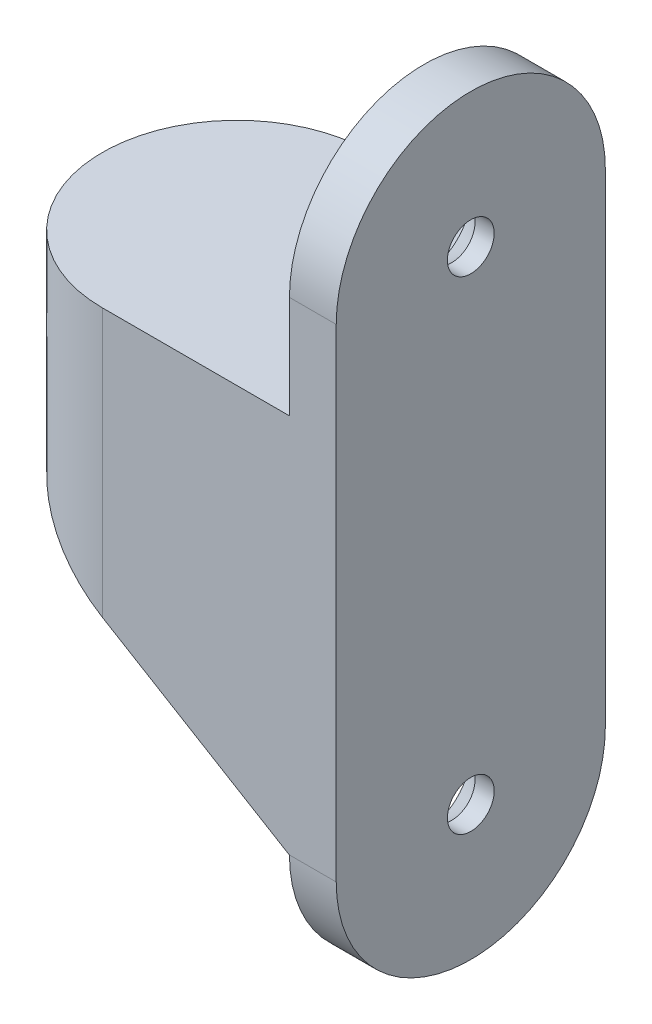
ISO-10303-21;
HEADER;
FILE_DESCRIPTION(('STEP AP214'),'2;1');
FILE_NAME('part.step','',(''),(''),'','','');
FILE_SCHEMA(('AUTOMOTIVE_DESIGN { 1 0 10303 214 1 1 1 1 }'));
ENDSEC;
DATA;
#1=APPLICATION_CONTEXT('core data for automotive mechanical design processes');
#2=APPLICATION_PROTOCOL_DEFINITION('international standard','automotive_design',2000,#1);
#3=PRODUCT_CONTEXT('',#1,'mechanical');
#4=PRODUCT('Part','Part','',(#3));
#5=PRODUCT_RELATED_PRODUCT_CATEGORY('part','',(#4));
#6=PRODUCT_DEFINITION_FORMATION('','',#4);
#7=PRODUCT_DEFINITION_CONTEXT('part definition',#1,'design');
#8=PRODUCT_DEFINITION('design','',#6,#7);
#9=PRODUCT_DEFINITION_SHAPE('','',#8);
#10=(LENGTH_UNIT() NAMED_UNIT(*) SI_UNIT(.MILLI.,.METRE.));
#11=(NAMED_UNIT(*) PLANE_ANGLE_UNIT() SI_UNIT($,.RADIAN.));
#12=(NAMED_UNIT(*) SI_UNIT($,.STERADIAN.) SOLID_ANGLE_UNIT());
#13=UNCERTAINTY_MEASURE_WITH_UNIT(LENGTH_MEASURE(1.E-05),#10,'distance_accuracy_value','');
#14=(GEOMETRIC_REPRESENTATION_CONTEXT(3) GLOBAL_UNCERTAINTY_ASSIGNED_CONTEXT((#13)) GLOBAL_UNIT_ASSIGNED_CONTEXT((#10,
#11,#12)) REPRESENTATION_CONTEXT('',''));
#15=CARTESIAN_POINT('',(0.,0.,0.));
#16=DIRECTION('',(0.,0.,1.));
#17=DIRECTION('',(1.,0.,0.));
#18=AXIS2_PLACEMENT_3D('',#15,#16,#17);
#19=CARTESIAN_POINT('',(18.25625,-24.6438213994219,0.));
#20=DIRECTION('',(-0.515038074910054,-0.857167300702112,0.));
#21=DIRECTION('',(0.857167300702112,-0.515038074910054,0.));
#22=AXIS2_PLACEMENT_3D('',#19,#20,#21);
#23=PLANE('',#22);
#24=DIRECTION('',(0.,0.,1.));
#25=VECTOR('',#24,1.);
#26=CARTESIAN_POINT('',(18.25625,-24.6438213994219,0.));
#27=LINE('',#26,#25);
#28=CARTESIAN_POINT('',(18.25625,-24.6438213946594,9.39193072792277E-06));
#29=VERTEX_POINT('',#28);
#30=CARTESIAN_POINT('',(18.25625,-24.6438213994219,11.8237));
#31=VERTEX_POINT('',#30);
#32=EDGE_CURVE('E153',#29,#31,#27,.T.);
#33=ORIENTED_EDGE('',*,*,#32,.T.);
#34=CARTESIAN_POINT('',(18.25625,-24.6438213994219,18.2626));
#35=DIRECTION('',(-0.515038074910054,-0.857167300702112,0.));
#36=DIRECTION('',(0.857167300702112,-0.515038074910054,0.));
#37=AXIS2_PLACEMENT_3D('',#34,#35,#36);
#38=ELLIPSE('',#37,12.5017941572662,6.43889999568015);
#39=CARTESIAN_POINT('',(18.25625,-24.6438213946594,24.7014999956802));
#40=VERTEX_POINT('',#39);
#41=EDGE_CURVE('E49',#31,#40,#38,.F.);
#42=ORIENTED_EDGE('',*,*,#41,.T.);
#43=CARTESIAN_POINT('',(18.25625,-24.6438213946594,36.5251906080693));
#44=VERTEX_POINT('',#43);
#45=EDGE_CURVE('E156',#40,#44,#27,.T.);
#46=ORIENTED_EDGE('',*,*,#45,.T.);
#47=CARTESIAN_POINT('',(18.2254252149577,-24.6253,36.5252));
#48=CARTESIAN_POINT('',(18.2267095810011,-24.6260717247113,36.5252));
#49=CARTESIAN_POINT('',(18.2279939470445,-24.6268434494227,36.5251999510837));
#50=CARTESIAN_POINT('',(18.2305626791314,-24.6283868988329,36.5251997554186));
#51=CARTESIAN_POINT('',(18.2318470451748,-24.6291586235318,36.5251996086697));
#52=CARTESIAN_POINT('',(18.2344157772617,-24.6307020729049,36.5251992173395));
#53=CARTESIAN_POINT('',(18.2357001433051,-24.631473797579,36.525198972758));
#54=CARTESIAN_POINT('',(18.238268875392,-24.6330172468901,36.5251983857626));
#55=CARTESIAN_POINT('',(18.2395532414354,-24.633788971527,36.5251980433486));
#56=CARTESIAN_POINT('',(18.2421219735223,-24.6353324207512,36.5251972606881));
#57=CARTESIAN_POINT('',(18.2434063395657,-24.6361041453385,36.5251968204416));
#58=CARTESIAN_POINT('',(18.2459750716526,-24.6376475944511,36.5251958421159));
#59=CARTESIAN_POINT('',(18.247259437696,-24.6384193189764,36.5251953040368));
#60=CARTESIAN_POINT('',(18.2498281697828,-24.6399627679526,36.5251941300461));
#61=CARTESIAN_POINT('',(18.2511125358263,-24.6407344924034,36.5251934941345));
#62=CARTESIAN_POINT('',(18.2536812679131,-24.6422779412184,36.5251921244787));
#63=CARTESIAN_POINT('',(18.2549656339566,-24.6430496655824,36.5251913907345));
#64=CARTESIAN_POINT('',(18.25625,-24.6438213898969,36.5251906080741));
#65=B_SPLINE_CURVE_WITH_KNOTS('',3,(#47,#48,#49,#50,#51,#52,#53,#54,#55,#56,#57,#58,#59,#60,#61,
#62,#63,#64),.UNSPECIFIED.,.F.,.F.,(4,2,2,2,2,2,2,2,4),(0.,0.00449515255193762,
0.00899030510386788,0.0134854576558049,0.0179806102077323,0.0224757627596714,0.0269709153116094,
0.0314660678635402,0.035961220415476),.UNSPECIFIED.);
#66=CARTESIAN_POINT('',(18.2254252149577,-24.6253,36.5252));
#67=VERTEX_POINT('',#66);
#68=EDGE_CURVE('E183',#67,#44,#65,.T.);
#69=ORIENTED_EDGE('',*,*,#68,.F.);
#70=DIRECTION('',(0.857167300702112,-0.515038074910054,0.));
#71=VECTOR('',#70,1.);
#72=CARTESIAN_POINT('',(-7.1374,-9.38577714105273,36.5252));
#73=LINE('',#72,#71);
#74=CARTESIAN_POINT('',(-7.1374,-9.38577714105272,36.5252));
#75=VERTEX_POINT('',#74);
#76=EDGE_CURVE('E134',#75,#67,#73,.T.);
#77=ORIENTED_EDGE('',*,*,#76,.F.);
#78=CARTESIAN_POINT('',(-7.1374,-9.38577714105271,18.2626));
#79=DIRECTION('',(-0.515038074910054,-0.857167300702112,0.));
#80=DIRECTION('',(-0.857167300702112,0.515038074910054,0.));
#81=AXIS2_PLACEMENT_3D('',#78,#79,#80);
#82=ELLIPSE('',#81,21.3057590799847,18.2626);
#83=CARTESIAN_POINT('',(-7.1374,-9.38577714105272,0.));
#84=VERTEX_POINT('',#83);
#85=EDGE_CURVE('E154',#75,#84,#82,.T.);
#86=ORIENTED_EDGE('',*,*,#85,.T.);
#87=DIRECTION('',(0.857167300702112,-0.515038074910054,0.));
#88=VECTOR('',#87,1.);
#89=CARTESIAN_POINT('',(-7.1374,-9.38577714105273,0.));
#90=LINE('',#89,#88);
#91=CARTESIAN_POINT('',(18.2254252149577,-24.6253,0.));
#92=VERTEX_POINT('',#91);
#93=EDGE_CURVE('E167',#84,#92,#90,.T.);
#94=ORIENTED_EDGE('',*,*,#93,.T.);
#95=CARTESIAN_POINT('',(18.25625,-24.6438213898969,9.39192589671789E-06));
#96=CARTESIAN_POINT('',(18.2549656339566,-24.6430496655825,8.60926547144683E-06));
#97=CARTESIAN_POINT('',(18.2536812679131,-24.6422779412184,7.87552130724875E-06));
#98=CARTESIAN_POINT('',(18.2511125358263,-24.6407344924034,6.50586551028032E-06));
#99=CARTESIAN_POINT('',(18.2498281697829,-24.6399627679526,5.86995387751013E-06));
#100=CARTESIAN_POINT('',(18.247259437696,-24.6384193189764,4.69596315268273E-06));
#101=CARTESIAN_POINT('',(18.2459750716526,-24.6376475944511,4.15788406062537E-06));
#102=CARTESIAN_POINT('',(18.2434063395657,-24.6361041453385,3.17955842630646E-06));
#103=CARTESIAN_POINT('',(18.2421219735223,-24.6353324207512,2.73931188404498E-06));
#104=CARTESIAN_POINT('',(18.2395532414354,-24.633788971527,1.95665135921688E-06));
#105=CARTESIAN_POINT('',(18.238268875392,-24.6330172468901,1.61423737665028E-06));
#106=CARTESIAN_POINT('',(18.2357001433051,-24.631473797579,1.02724197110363E-06));
#107=CARTESIAN_POINT('',(18.2344157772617,-24.6307020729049,7.82660548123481E-07));
#108=CARTESIAN_POINT('',(18.2318470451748,-24.6291586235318,3.91330273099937E-07));
#109=CARTESIAN_POINT('',(18.2305626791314,-24.6283868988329,2.44581421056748E-07));
#110=CARTESIAN_POINT('',(18.2279939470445,-24.6268434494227,4.89162842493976E-08));
#111=CARTESIAN_POINT('',(18.2267095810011,-24.6260717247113,0.));
#112=CARTESIAN_POINT('',(18.2254252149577,-24.6253,0.));
#113=B_SPLINE_CURVE_WITH_KNOTS('',3,(#95,#96,#97,#98,#99,#100,#101,#102,#103,#104,#105,#106,
#107,#108,#109,#110,#111,#112),.UNSPECIFIED.,.F.,.F.,(4,2,2,2,2,2,2,2,4),(0.,
0.00449515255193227,0.00899030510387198,0.0134854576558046,0.0179806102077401,
0.0224757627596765,0.0269709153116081,0.0314660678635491,0.0359612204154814),.UNSPECIFIED.);
#114=EDGE_CURVE('E150',#29,#92,#113,.T.);
#115=ORIENTED_EDGE('',*,*,#114,.F.);
#116=EDGE_LOOP('',(#33,#42,#46,#69,#77,#86,#94,#115));
#117=FACE_BOUND('',#116,.T.);
#118=ADVANCED_FACE('F33',(#117),#23,.T.);
#119=CARTESIAN_POINT('',(18.25625,-42.8879,0.));
#120=DIRECTION('',(-1.,0.,0.));
#121=DIRECTION('',(0.,0.,1.));
#122=AXIS2_PLACEMENT_3D('',#119,#120,#121);
#123=PLANE('',#122);
#124=CARTESIAN_POINT('',(18.25625,-24.6438213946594,18.2626));
#125=DIRECTION('',(-1.,0.,0.));
#126=DIRECTION('',(0.,0.,1.));
#127=AXIS2_PLACEMENT_3D('',#124,#125,#126);
#128=CIRCLE('',#127,6.4389);
#129=EDGE_CURVE('E242',#31,#40,#128,.T.);
#130=ORIENTED_EDGE('',*,*,#129,.F.);
#131=ORIENTED_EDGE('',*,*,#32,.F.);
#132=CARTESIAN_POINT('',(18.25625,-24.6253,18.2626));
#133=DIRECTION('',(-1.,0.,0.));
#134=DIRECTION('',(0.,0.,1.));
#135=AXIS2_PLACEMENT_3D('',#132,#133,#134);
#136=CIRCLE('',#135,18.2626);
#137=EDGE_CURVE('E128',#44,#29,#136,.F.);
#138=ORIENTED_EDGE('',*,*,#137,.F.);
#139=ORIENTED_EDGE('',*,*,#45,.F.);
#140=EDGE_LOOP('',(#130,#131,#138,#139));
#141=FACE_BOUND('',#140,.T.);
#142=ADVANCED_FACE('F35',(#141),#123,.T.);
#143=CARTESIAN_POINT('',(18.25625,26.9875,0.));
#144=DIRECTION('',(-1.,0.,0.));
#145=DIRECTION('',(0.,0.,1.));
#146=AXIS2_PLACEMENT_3D('',#143,#144,#145);
#147=PLANE('',#146);
#148=CARTESIAN_POINT('',(18.25625,40.9067,18.2626));
#149=DIRECTION('',(-1.,0.,0.));
#150=DIRECTION('',(0.,0.,1.));
#151=AXIS2_PLACEMENT_3D('',#148,#149,#150);
#152=CIRCLE('',#151,6.4389);
#153=CARTESIAN_POINT('',(18.25625,40.9067,24.7015));
#154=VERTEX_POINT('',#153);
#155=EDGE_CURVE('E231',#154,#154,#152,.T.);
#156=ORIENTED_EDGE('',*,*,#155,.F.);
#157=EDGE_LOOP('',(#156));
#158=FACE_BOUND('',#157,.T.);
#159=DIRECTION('',(0.,0.,1.));
#160=VECTOR('',#159,1.);
#161=CARTESIAN_POINT('',(18.25625,26.9875,0.));
#162=LINE('',#161,#160);
#163=CARTESIAN_POINT('',(18.25625,26.9875,36.5252));
#164=VERTEX_POINT('',#163);
#165=CARTESIAN_POINT('',(18.25625,26.9875,0.));
#166=VERTEX_POINT('',#165);
#167=EDGE_CURVE('E114',#164,#166,#162,.F.);
#168=ORIENTED_EDGE('',*,*,#167,.F.);
#169=DIRECTION('',(0.,1.,0.));
#170=VECTOR('',#169,1.);
#171=CARTESIAN_POINT('',(18.25625,9.3223426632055,36.5252));
#172=LINE('',#171,#170);
#173=CARTESIAN_POINT('',(18.25625,40.9067,36.5252));
#174=VERTEX_POINT('',#173);
#175=EDGE_CURVE('E118',#174,#164,#172,.F.);
#176=ORIENTED_EDGE('',*,*,#175,.F.);
#177=CARTESIAN_POINT('',(18.25625,40.9067,18.2626));
#178=DIRECTION('',(1.,0.,0.));
#179=DIRECTION('',(0.,0.,-1.));
#180=AXIS2_PLACEMENT_3D('',#177,#178,#179);
#181=CIRCLE('',#180,18.2626);
#182=CARTESIAN_POINT('',(18.25625,40.9067,0.));
#183=VERTEX_POINT('',#182);
#184=EDGE_CURVE('E151',#183,#174,#181,.T.);
#185=ORIENTED_EDGE('',*,*,#184,.F.);
#186=DIRECTION('',(0.,1.,0.));
#187=VECTOR('',#186,1.);
#188=CARTESIAN_POINT('',(18.25625,9.3223426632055,0.));
#189=LINE('',#188,#187);
#190=EDGE_CURVE('E111',#183,#166,#189,.F.);
#191=ORIENTED_EDGE('',*,*,#190,.T.);
#192=EDGE_LOOP('',(#168,#176,#185,#191));
#193=FACE_BOUND('',#192,.T.);
#194=ADVANCED_FACE('F116',(#158,#193),#147,.T.);
#195=CARTESIAN_POINT('',(-25.4,26.9875,0.));
#196=DIRECTION('',(0.,1.,0.));
#197=DIRECTION('',(0.,0.,1.));
#198=AXIS2_PLACEMENT_3D('',#195,#196,#197);
#199=PLANE('',#198);
#200=ORIENTED_EDGE('',*,*,#167,.T.);
#201=DIRECTION('',(1.,0.,0.));
#202=VECTOR('',#201,1.);
#203=CARTESIAN_POINT('',(9.54165738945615,26.9875,0.));
#204=LINE('',#203,#202);
#205=CARTESIAN_POINT('',(-7.1374,26.9875,0.));
#206=VERTEX_POINT('',#205);
#207=EDGE_CURVE('E104',#166,#206,#204,.F.);
#208=ORIENTED_EDGE('',*,*,#207,.T.);
#209=CARTESIAN_POINT('',(-7.13740000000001,26.9875,18.2626));
#210=DIRECTION('',(0.,1.,0.));
#211=DIRECTION('',(-1.,0.,0.));
#212=AXIS2_PLACEMENT_3D('',#209,#210,#211);
#213=CIRCLE('',#212,18.2626);
#214=CARTESIAN_POINT('',(-7.1374,26.9875,36.5252));
#215=VERTEX_POINT('',#214);
#216=EDGE_CURVE('E37',#215,#206,#213,.F.);
#217=ORIENTED_EDGE('',*,*,#216,.F.);
#218=DIRECTION('',(1.,0.,0.));
#219=VECTOR('',#218,1.);
#220=CARTESIAN_POINT('',(9.54165738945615,26.9875,36.5252));
#221=LINE('',#220,#219);
#222=EDGE_CURVE('E123',#164,#215,#221,.F.);
#223=ORIENTED_EDGE('',*,*,#222,.F.);
#224=EDGE_LOOP('',(#200,#208,#217,#223));
#225=FACE_BOUND('',#224,.T.);
#226=ADVANCED_FACE('F124',(#225),#199,.T.);
#227=CARTESIAN_POINT('',(-7.1374,5.45492133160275,18.2626));
#228=DIRECTION('',(0.,1.,0.));
#229=DIRECTION('',(-1.,0.,0.));
#230=AXIS2_PLACEMENT_3D('',#227,#228,#229);
#231=CYLINDRICAL_SURFACE('',#230,18.2626);
#232=ORIENTED_EDGE('',*,*,#85,.F.);
#233=DIRECTION('',(0.,1.,0.));
#234=VECTOR('',#233,1.);
#235=CARTESIAN_POINT('',(-7.1374,9.3223426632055,36.5252));
#236=LINE('',#235,#234);
#237=EDGE_CURVE('E152',#215,#75,#236,.F.);
#238=ORIENTED_EDGE('',*,*,#237,.F.);
#239=ORIENTED_EDGE('',*,*,#216,.T.);
#240=DIRECTION('',(0.,1.,0.));
#241=VECTOR('',#240,1.);
#242=CARTESIAN_POINT('',(-7.1374,9.3223426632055,0.));
#243=LINE('',#242,#241);
#244=EDGE_CURVE('E164',#206,#84,#243,.F.);
#245=ORIENTED_EDGE('',*,*,#244,.T.);
#246=EDGE_LOOP('',(#232,#238,#239,#245));
#247=FACE_BOUND('',#246,.T.);
#248=ADVANCED_FACE('F163',(#247),#231,.T.);
#249=CARTESIAN_POINT('',(13.8989536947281,40.9067,18.2626));
#250=DIRECTION('',(1.,0.,0.));
#251=DIRECTION('',(0.,0.,-1.));
#252=AXIS2_PLACEMENT_3D('',#249,#250,#251);
#253=CYLINDRICAL_SURFACE('',#252,18.2626);
#254=ORIENTED_EDGE('',*,*,#184,.T.);
#255=DIRECTION('',(1.,0.,0.));
#256=VECTOR('',#255,1.);
#257=CARTESIAN_POINT('',(9.54165738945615,40.9067,36.5252));
#258=LINE('',#257,#256);
#259=CARTESIAN_POINT('',(24.60625,40.9067,36.5252));
#260=VERTEX_POINT('',#259);
#261=EDGE_CURVE('E132',#260,#174,#258,.F.);
#262=ORIENTED_EDGE('',*,*,#261,.F.);
#263=CARTESIAN_POINT('',(24.60625,40.9067,18.2626));
#264=DIRECTION('',(1.,0.,0.));
#265=DIRECTION('',(0.,0.,-1.));
#266=AXIS2_PLACEMENT_3D('',#263,#264,#265);
#267=CIRCLE('',#266,18.2626);
#268=CARTESIAN_POINT('',(24.60625,40.9067,0.));
#269=VERTEX_POINT('',#268);
#270=EDGE_CURVE('E144',#269,#260,#267,.T.);
#271=ORIENTED_EDGE('',*,*,#270,.F.);
#272=DIRECTION('',(1.,0.,0.));
#273=VECTOR('',#272,1.);
#274=CARTESIAN_POINT('',(9.54165738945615,40.9067,0.));
#275=LINE('',#274,#273);
#276=EDGE_CURVE('E147',#269,#183,#275,.F.);
#277=ORIENTED_EDGE('',*,*,#276,.T.);
#278=EDGE_LOOP('',(#254,#262,#271,#277));
#279=FACE_BOUND('',#278,.T.);
#280=ADVANCED_FACE('F210',(#279),#253,.T.);
#281=CARTESIAN_POINT('',(9.54165738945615,9.3223426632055,36.5252));
#282=DIRECTION('',(0.,0.,1.));
#283=DIRECTION('',(1.,0.,0.));
#284=AXIS2_PLACEMENT_3D('',#281,#282,#283);
#285=PLANE('',#284);
#286=ORIENTED_EDGE('',*,*,#175,.T.);
#287=ORIENTED_EDGE('',*,*,#222,.T.);
#288=ORIENTED_EDGE('',*,*,#237,.T.);
#289=ORIENTED_EDGE('',*,*,#76,.T.);
#290=DIRECTION('',(-1.,0.,0.));
#291=VECTOR('',#290,1.);
#292=CARTESIAN_POINT('',(17.0739536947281,-24.6253,36.5252));
#293=LINE('',#292,#291);
#294=CARTESIAN_POINT('',(24.60625,-24.6253,36.5252));
#295=VERTEX_POINT('',#294);
#296=EDGE_CURVE('E181',#295,#67,#293,.T.);
#297=ORIENTED_EDGE('',*,*,#296,.F.);
#298=DIRECTION('',(0.,1.,0.));
#299=VECTOR('',#298,1.);
#300=CARTESIAN_POINT('',(24.60625,59.1693,36.5252));
#301=LINE('',#300,#299);
#302=EDGE_CURVE('E143',#260,#295,#301,.F.);
#303=ORIENTED_EDGE('',*,*,#302,.F.);
#304=ORIENTED_EDGE('',*,*,#261,.T.);
#305=EDGE_LOOP('',(#286,#287,#288,#289,#297,#303,#304));
#306=FACE_BOUND('',#305,.T.);
#307=ADVANCED_FACE('F130',(#306),#285,.T.);
#308=CARTESIAN_POINT('',(17.0739536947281,-24.6253,18.2626));
#309=DIRECTION('',(-1.,0.,0.));
#310=DIRECTION('',(0.,0.,1.));
#311=AXIS2_PLACEMENT_3D('',#308,#309,#310);
#312=CYLINDRICAL_SURFACE('',#311,18.2626);
#313=ORIENTED_EDGE('',*,*,#296,.T.);
#314=ORIENTED_EDGE('',*,*,#68,.T.);
#315=ORIENTED_EDGE('',*,*,#137,.T.);
#316=ORIENTED_EDGE('',*,*,#114,.T.);
#317=DIRECTION('',(1.,0.,0.));
#318=VECTOR('',#317,1.);
#319=CARTESIAN_POINT('',(9.54165738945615,-24.6253,0.));
#320=LINE('',#319,#318);
#321=CARTESIAN_POINT('',(24.60625,-24.6253,0.));
#322=VERTEX_POINT('',#321);
#323=EDGE_CURVE('E58',#92,#322,#320,.T.);
#324=ORIENTED_EDGE('',*,*,#323,.T.);
#325=CARTESIAN_POINT('',(24.60625,-24.6253,18.2626));
#326=DIRECTION('',(-1.,0.,0.));
#327=DIRECTION('',(0.,0.,1.));
#328=AXIS2_PLACEMENT_3D('',#325,#326,#327);
#329=CIRCLE('',#328,18.2626);
#330=EDGE_CURVE('E42',#295,#322,#329,.F.);
#331=ORIENTED_EDGE('',*,*,#330,.F.);
#332=EDGE_LOOP('',(#313,#314,#315,#316,#324,#331));
#333=FACE_BOUND('',#332,.T.);
#334=ADVANCED_FACE('F187',(#333),#312,.T.);
#335=CARTESIAN_POINT('',(9.54165738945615,9.3223426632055,0.));
#336=DIRECTION('',(0.,0.,1.));
#337=DIRECTION('',(1.,0.,0.));
#338=AXIS2_PLACEMENT_3D('',#335,#336,#337);
#339=PLANE('',#338);
#340=DIRECTION('',(0.,1.,0.));
#341=VECTOR('',#340,1.);
#342=CARTESIAN_POINT('',(24.60625,59.1693,0.));
#343=LINE('',#342,#341);
#344=EDGE_CURVE('E11',#322,#269,#343,.T.);
#345=ORIENTED_EDGE('',*,*,#344,.F.);
#346=ORIENTED_EDGE('',*,*,#323,.F.);
#347=ORIENTED_EDGE('',*,*,#93,.F.);
#348=ORIENTED_EDGE('',*,*,#244,.F.);
#349=ORIENTED_EDGE('',*,*,#207,.F.);
#350=ORIENTED_EDGE('',*,*,#190,.F.);
#351=ORIENTED_EDGE('',*,*,#276,.F.);
#352=EDGE_LOOP('',(#345,#346,#347,#348,#349,#350,#351));
#353=FACE_BOUND('',#352,.T.);
#354=ADVANCED_FACE('F166',(#353),#339,.F.);
#355=CARTESIAN_POINT('',(24.60625,59.1693,0.));
#356=DIRECTION('',(1.,0.,0.));
#357=DIRECTION('',(0.,0.,-1.));
#358=AXIS2_PLACEMENT_3D('',#355,#356,#357);
#359=PLANE('',#358);
#360=CARTESIAN_POINT('',(24.60625,40.9067,18.2626));
#361=DIRECTION('',(-1.,0.,0.));
#362=DIRECTION('',(0.,0.,1.));
#363=AXIS2_PLACEMENT_3D('',#360,#361,#362);
#364=CIRCLE('',#363,3.175);
#365=CARTESIAN_POINT('',(24.60625,40.9067,21.4376));
#366=VERTEX_POINT('',#365);
#367=EDGE_CURVE('E236',#366,#366,#364,.T.);
#368=ORIENTED_EDGE('',*,*,#367,.T.);
#369=EDGE_LOOP('',(#368));
#370=FACE_BOUND('',#369,.T.);
#371=CARTESIAN_POINT('',(24.60625,-24.6438213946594,18.2626));
#372=DIRECTION('',(-1.,0.,0.));
#373=DIRECTION('',(0.,0.,1.));
#374=AXIS2_PLACEMENT_3D('',#371,#372,#373);
#375=CIRCLE('',#374,3.175);
#376=CARTESIAN_POINT('',(24.60625,-24.6438213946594,21.4376));
#377=VERTEX_POINT('',#376);
#378=EDGE_CURVE('E120',#377,#377,#375,.T.);
#379=ORIENTED_EDGE('',*,*,#378,.T.);
#380=EDGE_LOOP('',(#379));
#381=FACE_BOUND('',#380,.T.);
#382=ORIENTED_EDGE('',*,*,#330,.T.);
#383=ORIENTED_EDGE('',*,*,#344,.T.);
#384=ORIENTED_EDGE('',*,*,#270,.T.);
#385=ORIENTED_EDGE('',*,*,#302,.T.);
#386=EDGE_LOOP('',(#382,#383,#384,#385));
#387=FACE_BOUND('',#386,.T.);
#388=ADVANCED_FACE('F216',(#370,#381,#387),#359,.T.);
#389=CARTESIAN_POINT('',(18.25625,-24.6438213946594,18.2626));
#390=DIRECTION('',(-1.,0.,0.));
#391=DIRECTION('',(0.,0.,1.));
#392=AXIS2_PLACEMENT_3D('',#389,#390,#391);
#393=CYLINDRICAL_SURFACE('',#392,3.175);
#394=ORIENTED_EDGE('',*,*,#378,.F.);
#395=EDGE_LOOP('',(#394));
#396=FACE_BOUND('',#395,.T.);
#397=CARTESIAN_POINT('',(22.0109374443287,-24.6438213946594,18.2626));
#398=DIRECTION('',(-1.,0.,0.));
#399=DIRECTION('',(0.,0.,1.));
#400=AXIS2_PLACEMENT_3D('',#397,#398,#399);
#401=CIRCLE('',#400,3.175);
#402=CARTESIAN_POINT('',(22.0109374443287,-24.6438213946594,21.4376));
#403=VERTEX_POINT('',#402);
#404=EDGE_CURVE('E245',#403,#403,#401,.T.);
#405=ORIENTED_EDGE('',*,*,#404,.T.);
#406=EDGE_LOOP('',(#405));
#407=FACE_BOUND('',#406,.T.);
#408=ADVANCED_FACE('F228',(#396,#407),#393,.F.);
#409=CARTESIAN_POINT('',(18.25625,-24.6438213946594,18.2626));
#410=DIRECTION('',(-1.,0.,0.));
#411=DIRECTION('',(0.,0.,1.));
#412=AXIS2_PLACEMENT_3D('',#409,#410,#411);
#413=CONICAL_SURFACE('',#412,6.4389,0.715584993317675);
#414=ORIENTED_EDGE('',*,*,#404,.F.);
#415=EDGE_LOOP('',(#414));
#416=FACE_BOUND('',#415,.T.);
#417=EDGE_CURVE('E243',#40,#31,#128,.T.);
#418=ORIENTED_EDGE('',*,*,#417,.T.);
#419=ORIENTED_EDGE('',*,*,#129,.T.);
#420=EDGE_LOOP('',(#418,#419));
#421=FACE_BOUND('',#420,.T.);
#422=ADVANCED_FACE('F259',(#416,#421),#413,.F.);
#423=CARTESIAN_POINT('',(18.25625,40.9067,18.2626));
#424=DIRECTION('',(-1.,0.,0.));
#425=DIRECTION('',(0.,0.,1.));
#426=AXIS2_PLACEMENT_3D('',#423,#424,#425);
#427=CYLINDRICAL_SURFACE('',#426,3.175);
#428=ORIENTED_EDGE('',*,*,#367,.F.);
#429=EDGE_LOOP('',(#428));
#430=FACE_BOUND('',#429,.T.);
#431=CARTESIAN_POINT('',(22.0109374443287,40.9067,18.2626));
#432=DIRECTION('',(-1.,0.,0.));
#433=DIRECTION('',(0.,0.,1.));
#434=AXIS2_PLACEMENT_3D('',#431,#432,#433);
#435=CIRCLE('',#434,3.175);
#436=CARTESIAN_POINT('',(22.0109374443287,40.9067,21.4376));
#437=VERTEX_POINT('',#436);
#438=EDGE_CURVE('E233',#437,#437,#435,.T.);
#439=ORIENTED_EDGE('',*,*,#438,.T.);
#440=EDGE_LOOP('',(#439));
#441=FACE_BOUND('',#440,.T.);
#442=ADVANCED_FACE('F267',(#430,#441),#427,.F.);
#443=CARTESIAN_POINT('',(18.25625,40.9067,18.2626));
#444=DIRECTION('',(-1.,0.,0.));
#445=DIRECTION('',(0.,0.,1.));
#446=AXIS2_PLACEMENT_3D('',#443,#444,#445);
#447=CONICAL_SURFACE('',#446,6.4389,0.715584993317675);
#448=ORIENTED_EDGE('',*,*,#438,.F.);
#449=EDGE_LOOP('',(#448));
#450=FACE_BOUND('',#449,.T.);
#451=ORIENTED_EDGE('',*,*,#155,.T.);
#452=EDGE_LOOP('',(#451));
#453=FACE_BOUND('',#452,.T.);
#454=ADVANCED_FACE('F271',(#450,#453),#447,.F.);
#455=CARTESIAN_POINT('',(-25.4,-24.6438213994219,18.2626));
#456=DIRECTION('',(1.,0.,0.));
#457=DIRECTION('',(0.,0.,-1.));
#458=AXIS2_PLACEMENT_3D('',#455,#456,#457);
#459=CYLINDRICAL_SURFACE('',#458,6.43889999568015);
#460=ORIENTED_EDGE('',*,*,#417,.F.);
#461=ORIENTED_EDGE('',*,*,#41,.F.);
#462=EDGE_LOOP('',(#460,#461));
#463=FACE_BOUND('',#462,.T.);
#464=ADVANCED_FACE('F275',(#463),#459,.F.);
#465=CLOSED_SHELL('',(#118,#142,#194,#226,#248,#280,#307,#334,#354,#388,#408,#422,#442,#454,#464));
#466=MANIFOLD_SOLID_BREP('B2',#465);
#467=ADVANCED_BREP_SHAPE_REPRESENTATION('',(#18,#466),#14);
#468=SHAPE_DEFINITION_REPRESENTATION(#9,#467);
ENDSEC;
END-ISO-10303-21;
